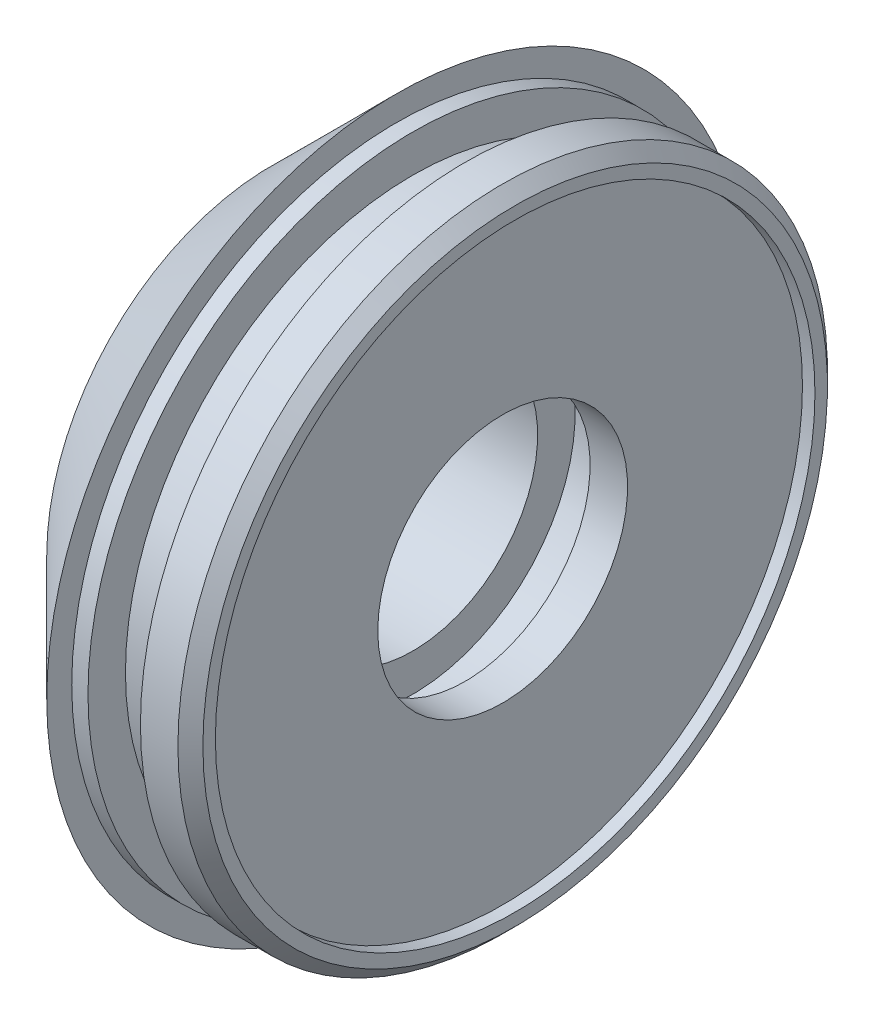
ISO-10303-21;
HEADER;
FILE_DESCRIPTION(('STEP AP214'),'2;1');
FILE_NAME('part.step','',(''),(''),'','','');
FILE_SCHEMA(('AUTOMOTIVE_DESIGN { 1 0 10303 214 1 1 1 1 }'));
ENDSEC;
DATA;
#1=APPLICATION_CONTEXT('core data for automotive mechanical design processes');
#2=APPLICATION_PROTOCOL_DEFINITION('international standard','automotive_design',2000,#1);
#3=PRODUCT_CONTEXT('',#1,'mechanical');
#4=PRODUCT('Part','Part','',(#3));
#5=PRODUCT_RELATED_PRODUCT_CATEGORY('part','',(#4));
#6=PRODUCT_DEFINITION_FORMATION('','',#4);
#7=PRODUCT_DEFINITION_CONTEXT('part definition',#1,'design');
#8=PRODUCT_DEFINITION('design','',#6,#7);
#9=PRODUCT_DEFINITION_SHAPE('','',#8);
#10=(LENGTH_UNIT() NAMED_UNIT(*) SI_UNIT(.MILLI.,.METRE.));
#11=(NAMED_UNIT(*) PLANE_ANGLE_UNIT() SI_UNIT($,.RADIAN.));
#12=(NAMED_UNIT(*) SI_UNIT($,.STERADIAN.) SOLID_ANGLE_UNIT());
#13=UNCERTAINTY_MEASURE_WITH_UNIT(LENGTH_MEASURE(1.E-05),#10,'distance_accuracy_value','');
#14=(GEOMETRIC_REPRESENTATION_CONTEXT(3) GLOBAL_UNCERTAINTY_ASSIGNED_CONTEXT((#13)) GLOBAL_UNIT_ASSIGNED_CONTEXT((#10,
#11,#12)) REPRESENTATION_CONTEXT('',''));
#15=CARTESIAN_POINT('',(0.,0.,0.));
#16=DIRECTION('',(0.,0.,1.));
#17=DIRECTION('',(1.,0.,0.));
#18=AXIS2_PLACEMENT_3D('',#15,#16,#17);
#19=CARTESIAN_POINT('',(-30.,0.,0.));
#20=DIRECTION('',(-1.,0.,0.));
#21=DIRECTION('',(0.,0.,1.));
#22=AXIS2_PLACEMENT_3D('',#19,#20,#21);
#23=CYLINDRICAL_SURFACE('',#22,11.5);
#24=CARTESIAN_POINT('',(5.65,0.,0.));
#25=DIRECTION('',(-1.,0.,0.));
#26=DIRECTION('',(0.,0.,1.));
#27=AXIS2_PLACEMENT_3D('',#24,#25,#26);
#28=CIRCLE('',#27,11.5);
#29=CARTESIAN_POINT('',(5.65,0.,11.5));
#30=VERTEX_POINT('',#29);
#31=EDGE_CURVE('E10',#30,#30,#28,.T.);
#32=ORIENTED_EDGE('',*,*,#31,.F.);
#33=EDGE_LOOP('',(#32));
#34=FACE_BOUND('',#33,.T.);
#35=CARTESIAN_POINT('',(7.75,0.,0.));
#36=DIRECTION('',(-1.,0.,0.));
#37=DIRECTION('',(0.,0.,1.));
#38=AXIS2_PLACEMENT_3D('',#35,#36,#37);
#39=CIRCLE('',#38,11.5);
#40=CARTESIAN_POINT('',(7.75,0.,11.5));
#41=VERTEX_POINT('',#40);
#42=EDGE_CURVE('E106',#41,#41,#39,.T.);
#43=ORIENTED_EDGE('',*,*,#42,.T.);
#44=EDGE_LOOP('',(#43));
#45=FACE_BOUND('',#44,.T.);
#46=ADVANCED_FACE('F35',(#34,#45),#23,.T.);
#47=CARTESIAN_POINT('',(5.65,13.,0.));
#48=DIRECTION('',(-1.,0.,0.));
#49=DIRECTION('',(0.,0.,1.));
#50=AXIS2_PLACEMENT_3D('',#47,#48,#49);
#51=PLANE('',#50);
#52=CARTESIAN_POINT('',(5.65,0.,0.));
#53=DIRECTION('',(-1.,0.,0.));
#54=DIRECTION('',(0.,0.,1.));
#55=AXIS2_PLACEMENT_3D('',#52,#53,#54);
#56=CIRCLE('',#55,13.);
#57=CARTESIAN_POINT('',(5.65,0.,13.));
#58=VERTEX_POINT('',#57);
#59=EDGE_CURVE('E42',#58,#58,#56,.T.);
#60=ORIENTED_EDGE('',*,*,#59,.F.);
#61=EDGE_LOOP('',(#60));
#62=FACE_BOUND('',#61,.T.);
#63=ORIENTED_EDGE('',*,*,#31,.T.);
#64=EDGE_LOOP('',(#63));
#65=FACE_BOUND('',#64,.T.);
#66=ADVANCED_FACE('F198',(#62,#65),#51,.F.);
#67=CARTESIAN_POINT('',(-30.,0.,0.));
#68=DIRECTION('',(-1.,0.,0.));
#69=DIRECTION('',(0.,0.,1.));
#70=AXIS2_PLACEMENT_3D('',#67,#68,#69);
#71=CYLINDRICAL_SURFACE('',#70,13.);
#72=CARTESIAN_POINT('',(5.,0.,0.));
#73=DIRECTION('',(-1.,0.,0.));
#74=DIRECTION('',(0.,0.,1.));
#75=AXIS2_PLACEMENT_3D('',#72,#73,#74);
#76=CIRCLE('',#75,13.);
#77=CARTESIAN_POINT('',(5.,0.,13.));
#78=VERTEX_POINT('',#77);
#79=EDGE_CURVE('E49',#78,#78,#76,.T.);
#80=ORIENTED_EDGE('',*,*,#79,.F.);
#81=EDGE_LOOP('',(#80));
#82=FACE_BOUND('',#81,.T.);
#83=ORIENTED_EDGE('',*,*,#59,.T.);
#84=EDGE_LOOP('',(#83));
#85=FACE_BOUND('',#84,.T.);
#86=ADVANCED_FACE('F193',(#82,#85),#71,.T.);
#87=CARTESIAN_POINT('',(4.99999999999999,14.0000000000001,-1.11022302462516E-13));
#88=DIRECTION('',(-1.,0.,0.));
#89=DIRECTION('',(0.,0.,1.));
#90=AXIS2_PLACEMENT_3D('',#87,#88,#89);
#91=PLANE('',#90);
#92=CARTESIAN_POINT('',(5.,0.,0.));
#93=DIRECTION('',(-1.,0.,0.));
#94=DIRECTION('',(0.,0.,1.));
#95=AXIS2_PLACEMENT_3D('',#92,#93,#94);
#96=CIRCLE('',#95,14.);
#97=CARTESIAN_POINT('',(5.,0.,14.));
#98=VERTEX_POINT('',#97);
#99=EDGE_CURVE('E55',#98,#98,#96,.T.);
#100=ORIENTED_EDGE('',*,*,#99,.F.);
#101=EDGE_LOOP('',(#100));
#102=FACE_BOUND('',#101,.T.);
#103=ORIENTED_EDGE('',*,*,#79,.T.);
#104=EDGE_LOOP('',(#103));
#105=FACE_BOUND('',#104,.T.);
#106=ADVANCED_FACE('F187',(#102,#105),#91,.F.);
#107=CARTESIAN_POINT('',(5.,0.,0.));
#108=DIRECTION('',(1.,0.,0.));
#109=DIRECTION('',(0.,0.,-1.));
#110=AXIS2_PLACEMENT_3D('',#107,#108,#109);
#111=CONICAL_SURFACE('',#110,14.,0.785398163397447);
#112=CARTESIAN_POINT('',(0.,0.,0.));
#113=DIRECTION('',(-1.,0.,0.));
#114=DIRECTION('',(0.,0.,1.));
#115=AXIS2_PLACEMENT_3D('',#112,#113,#114);
#116=CIRCLE('',#115,9.00000000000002);
#117=CARTESIAN_POINT('',(0.,0.,8.99999999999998));
#118=VERTEX_POINT('',#117);
#119=EDGE_CURVE('E61',#118,#118,#116,.T.);
#120=ORIENTED_EDGE('',*,*,#119,.F.);
#121=EDGE_LOOP('',(#120));
#122=FACE_BOUND('',#121,.T.);
#123=ORIENTED_EDGE('',*,*,#99,.T.);
#124=EDGE_LOOP('',(#123));
#125=FACE_BOUND('',#124,.T.);
#126=ADVANCED_FACE('F181',(#122,#125),#111,.T.);
#127=CARTESIAN_POINT('',(0.,4.99999999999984,-1.66533453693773E-13));
#128=DIRECTION('',(1.,0.,0.));
#129=DIRECTION('',(0.,0.,-1.));
#130=AXIS2_PLACEMENT_3D('',#127,#128,#129);
#131=PLANE('',#130);
#132=CARTESIAN_POINT('',(0.,0.,0.));
#133=DIRECTION('',(-1.,0.,0.));
#134=DIRECTION('',(0.,0.,1.));
#135=AXIS2_PLACEMENT_3D('',#132,#133,#134);
#136=CIRCLE('',#135,5.);
#137=CARTESIAN_POINT('',(0.,0.,4.99999999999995));
#138=VERTEX_POINT('',#137);
#139=EDGE_CURVE('E65',#138,#138,#136,.T.);
#140=ORIENTED_EDGE('',*,*,#139,.F.);
#141=EDGE_LOOP('',(#140));
#142=FACE_BOUND('',#141,.T.);
#143=ORIENTED_EDGE('',*,*,#119,.T.);
#144=EDGE_LOOP('',(#143));
#145=FACE_BOUND('',#144,.T.);
#146=ADVANCED_FACE('F175',(#142,#145),#131,.F.);
#147=CARTESIAN_POINT('',(-30.,0.,0.));
#148=DIRECTION('',(-1.,0.,0.));
#149=DIRECTION('',(0.,0.,1.));
#150=AXIS2_PLACEMENT_3D('',#147,#148,#149);
#151=CYLINDRICAL_SURFACE('',#150,5.);
#152=CARTESIAN_POINT('',(5.65,0.,0.));
#153=DIRECTION('',(-1.,0.,0.));
#154=DIRECTION('',(0.,0.,1.));
#155=AXIS2_PLACEMENT_3D('',#152,#153,#154);
#156=CIRCLE('',#155,5.);
#157=CARTESIAN_POINT('',(5.65,0.,4.99999999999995));
#158=VERTEX_POINT('',#157);
#159=EDGE_CURVE('E69',#158,#158,#156,.T.);
#160=ORIENTED_EDGE('',*,*,#159,.F.);
#161=EDGE_LOOP('',(#160));
#162=FACE_BOUND('',#161,.T.);
#163=ORIENTED_EDGE('',*,*,#139,.T.);
#164=EDGE_LOOP('',(#163));
#165=FACE_BOUND('',#164,.T.);
#166=ADVANCED_FACE('F169',(#162,#165),#151,.F.);
#167=CARTESIAN_POINT('',(5.65,4.99999999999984,-1.66533453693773E-13));
#168=DIRECTION('',(-1.,0.,0.));
#169=DIRECTION('',(0.,0.,1.));
#170=AXIS2_PLACEMENT_3D('',#167,#168,#169);
#171=PLANE('',#170);
#172=CARTESIAN_POINT('',(5.65,0.,0.));
#173=DIRECTION('',(-1.,0.,0.));
#174=DIRECTION('',(0.,0.,1.));
#175=AXIS2_PLACEMENT_3D('',#172,#173,#174);
#176=CIRCLE('',#175,6.5);
#177=CARTESIAN_POINT('',(5.65,0.,6.49999999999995));
#178=VERTEX_POINT('',#177);
#179=EDGE_CURVE('E73',#178,#178,#176,.T.);
#180=ORIENTED_EDGE('',*,*,#179,.F.);
#181=EDGE_LOOP('',(#180));
#182=FACE_BOUND('',#181,.T.);
#183=ORIENTED_EDGE('',*,*,#159,.T.);
#184=EDGE_LOOP('',(#183));
#185=FACE_BOUND('',#184,.T.);
#186=ADVANCED_FACE('F163',(#182,#185),#171,.F.);
#187=CARTESIAN_POINT('',(-30.,0.,0.));
#188=DIRECTION('',(-1.,0.,0.));
#189=DIRECTION('',(0.,0.,1.));
#190=AXIS2_PLACEMENT_3D('',#187,#188,#189);
#191=CYLINDRICAL_SURFACE('',#190,6.5);
#192=CARTESIAN_POINT('',(7.75000000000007,0.,0.));
#193=DIRECTION('',(-1.,0.,0.));
#194=DIRECTION('',(0.,0.,1.));
#195=AXIS2_PLACEMENT_3D('',#192,#193,#194);
#196=CIRCLE('',#195,6.5);
#197=CARTESIAN_POINT('',(7.75000000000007,0.,6.49999999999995));
#198=VERTEX_POINT('',#197);
#199=EDGE_CURVE('E76',#198,#198,#196,.T.);
#200=ORIENTED_EDGE('',*,*,#199,.F.);
#201=EDGE_LOOP('',(#200));
#202=FACE_BOUND('',#201,.T.);
#203=ORIENTED_EDGE('',*,*,#179,.T.);
#204=EDGE_LOOP('',(#203));
#205=FACE_BOUND('',#204,.T.);
#206=ADVANCED_FACE('F157',(#202,#205),#191,.F.);
#207=CARTESIAN_POINT('',(7.75000000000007,6.50000000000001,0.));
#208=DIRECTION('',(1.,0.,0.));
#209=DIRECTION('',(0.,0.,-1.));
#210=AXIS2_PLACEMENT_3D('',#207,#208,#209);
#211=PLANE('',#210);
#212=CARTESIAN_POINT('',(7.75000000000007,0.,0.));
#213=DIRECTION('',(-1.,0.,0.));
#214=DIRECTION('',(0.,0.,1.));
#215=AXIS2_PLACEMENT_3D('',#212,#213,#214);
#216=CIRCLE('',#215,5.);
#217=CARTESIAN_POINT('',(7.75000000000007,0.,4.99999999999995));
#218=VERTEX_POINT('',#217);
#219=EDGE_CURVE('E80',#218,#218,#216,.T.);
#220=ORIENTED_EDGE('',*,*,#219,.F.);
#221=EDGE_LOOP('',(#220));
#222=FACE_BOUND('',#221,.T.);
#223=ORIENTED_EDGE('',*,*,#199,.T.);
#224=EDGE_LOOP('',(#223));
#225=FACE_BOUND('',#224,.T.);
#226=ADVANCED_FACE('F151',(#222,#225),#211,.F.);
#227=CARTESIAN_POINT('',(-30.,0.,0.));
#228=DIRECTION('',(-1.,0.,0.));
#229=DIRECTION('',(0.,0.,1.));
#230=AXIS2_PLACEMENT_3D('',#227,#228,#229);
#231=CYLINDRICAL_SURFACE('',#230,5.00000000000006);
#232=CARTESIAN_POINT('',(9.24999999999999,0.,0.));
#233=DIRECTION('',(-1.,0.,0.));
#234=DIRECTION('',(0.,0.,1.));
#235=AXIS2_PLACEMENT_3D('',#232,#233,#234);
#236=CIRCLE('',#235,5.00000000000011);
#237=CARTESIAN_POINT('',(9.24999999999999,0.,5.00000000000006));
#238=VERTEX_POINT('',#237);
#239=EDGE_CURVE('E84',#238,#238,#236,.T.);
#240=ORIENTED_EDGE('',*,*,#239,.F.);
#241=EDGE_LOOP('',(#240));
#242=FACE_BOUND('',#241,.T.);
#243=ORIENTED_EDGE('',*,*,#219,.T.);
#244=EDGE_LOOP('',(#243));
#245=FACE_BOUND('',#244,.T.);
#246=ADVANCED_FACE('F145',(#242,#245),#231,.F.);
#247=CARTESIAN_POINT('',(9.24999999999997,11.9999999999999,-1.11022302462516E-13));
#248=DIRECTION('',(-1.,0.,0.));
#249=DIRECTION('',(0.,0.,1.));
#250=AXIS2_PLACEMENT_3D('',#247,#248,#249);
#251=PLANE('',#250);
#252=CARTESIAN_POINT('',(9.24999999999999,0.,0.));
#253=DIRECTION('',(-1.,0.,0.));
#254=DIRECTION('',(0.,0.,1.));
#255=AXIS2_PLACEMENT_3D('',#252,#253,#254);
#256=CIRCLE('',#255,12.);
#257=CARTESIAN_POINT('',(9.24999999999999,0.,12.));
#258=VERTEX_POINT('',#257);
#259=EDGE_CURVE('E87',#258,#258,#256,.T.);
#260=ORIENTED_EDGE('',*,*,#259,.F.);
#261=EDGE_LOOP('',(#260));
#262=FACE_BOUND('',#261,.T.);
#263=ORIENTED_EDGE('',*,*,#239,.T.);
#264=EDGE_LOOP('',(#263));
#265=FACE_BOUND('',#264,.T.);
#266=ADVANCED_FACE('F139',(#262,#265),#251,.F.);
#267=CARTESIAN_POINT('',(-30.,0.,0.));
#268=DIRECTION('',(-1.,0.,0.));
#269=DIRECTION('',(0.,0.,1.));
#270=AXIS2_PLACEMENT_3D('',#267,#268,#269);
#271=CYLINDRICAL_SURFACE('',#270,12.);
#272=CARTESIAN_POINT('',(9.75,0.,0.));
#273=DIRECTION('',(-1.,0.,0.));
#274=DIRECTION('',(0.,0.,1.));
#275=AXIS2_PLACEMENT_3D('',#272,#273,#274);
#276=CIRCLE('',#275,12.);
#277=CARTESIAN_POINT('',(9.75,0.,12.));
#278=VERTEX_POINT('',#277);
#279=EDGE_CURVE('E91',#278,#278,#276,.T.);
#280=ORIENTED_EDGE('',*,*,#279,.F.);
#281=EDGE_LOOP('',(#280));
#282=FACE_BOUND('',#281,.T.);
#283=ORIENTED_EDGE('',*,*,#259,.T.);
#284=EDGE_LOOP('',(#283));
#285=FACE_BOUND('',#284,.T.);
#286=ADVANCED_FACE('F133',(#282,#285),#271,.F.);
#287=CARTESIAN_POINT('',(9.74999999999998,12.5,0.));
#288=DIRECTION('',(-1.,0.,0.));
#289=DIRECTION('',(0.,0.,1.));
#290=AXIS2_PLACEMENT_3D('',#287,#288,#289);
#291=PLANE('',#290);
#292=CARTESIAN_POINT('',(9.75,0.,0.));
#293=DIRECTION('',(-1.,0.,0.));
#294=DIRECTION('',(0.,0.,1.));
#295=AXIS2_PLACEMENT_3D('',#292,#293,#294);
#296=CIRCLE('',#295,12.5);
#297=CARTESIAN_POINT('',(9.75,0.,12.5));
#298=VERTEX_POINT('',#297);
#299=EDGE_CURVE('E94',#298,#298,#296,.T.);
#300=ORIENTED_EDGE('',*,*,#299,.F.);
#301=EDGE_LOOP('',(#300));
#302=FACE_BOUND('',#301,.T.);
#303=ORIENTED_EDGE('',*,*,#279,.T.);
#304=EDGE_LOOP('',(#303));
#305=FACE_BOUND('',#304,.T.);
#306=ADVANCED_FACE('F127',(#302,#305),#291,.F.);
#307=CARTESIAN_POINT('',(9.75,0.,0.));
#308=DIRECTION('',(-1.,0.,0.));
#309=DIRECTION('',(0.,0.,1.));
#310=AXIS2_PLACEMENT_3D('',#307,#308,#309);
#311=CONICAL_SURFACE('',#310,12.5,0.785398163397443);
#312=CARTESIAN_POINT('',(9.25,0.,0.));
#313=DIRECTION('',(-1.,0.,0.));
#314=DIRECTION('',(0.,0.,1.));
#315=AXIS2_PLACEMENT_3D('',#312,#313,#314);
#316=CIRCLE('',#315,13.);
#317=CARTESIAN_POINT('',(9.25,0.,13.));
#318=VERTEX_POINT('',#317);
#319=EDGE_CURVE('E98',#318,#318,#316,.T.);
#320=ORIENTED_EDGE('',*,*,#319,.F.);
#321=EDGE_LOOP('',(#320));
#322=FACE_BOUND('',#321,.T.);
#323=ORIENTED_EDGE('',*,*,#299,.T.);
#324=EDGE_LOOP('',(#323));
#325=FACE_BOUND('',#324,.T.);
#326=ADVANCED_FACE('F121',(#322,#325),#311,.T.);
#327=CARTESIAN_POINT('',(-30.,0.,0.));
#328=DIRECTION('',(-1.,0.,0.));
#329=DIRECTION('',(0.,0.,1.));
#330=AXIS2_PLACEMENT_3D('',#327,#328,#329);
#331=CYLINDRICAL_SURFACE('',#330,13.);
#332=CARTESIAN_POINT('',(7.75,0.,0.));
#333=DIRECTION('',(-1.,0.,0.));
#334=DIRECTION('',(0.,0.,1.));
#335=AXIS2_PLACEMENT_3D('',#332,#333,#334);
#336=CIRCLE('',#335,13.);
#337=CARTESIAN_POINT('',(7.75,0.,13.));
#338=VERTEX_POINT('',#337);
#339=EDGE_CURVE('E102',#338,#338,#336,.T.);
#340=ORIENTED_EDGE('',*,*,#339,.F.);
#341=EDGE_LOOP('',(#340));
#342=FACE_BOUND('',#341,.T.);
#343=ORIENTED_EDGE('',*,*,#319,.T.);
#344=EDGE_LOOP('',(#343));
#345=FACE_BOUND('',#344,.T.);
#346=ADVANCED_FACE('F115',(#342,#345),#331,.T.);
#347=CARTESIAN_POINT('',(7.74999999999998,11.5,-1.66533453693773E-13));
#348=DIRECTION('',(1.,0.,0.));
#349=DIRECTION('',(0.,0.,-1.));
#350=AXIS2_PLACEMENT_3D('',#347,#348,#349);
#351=PLANE('',#350);
#352=ORIENTED_EDGE('',*,*,#42,.F.);
#353=EDGE_LOOP('',(#352));
#354=FACE_BOUND('',#353,.T.);
#355=ORIENTED_EDGE('',*,*,#339,.T.);
#356=EDGE_LOOP('',(#355));
#357=FACE_BOUND('',#356,.T.);
#358=ADVANCED_FACE('F112',(#354,#357),#351,.F.);
#359=CLOSED_SHELL('',(#46,#66,#86,#106,#126,#146,#166,#186,#206,#226,#246,#266,#286,#306,#326,
#346,#358));
#360=MANIFOLD_SOLID_BREP('B2',#359);
#361=ADVANCED_BREP_SHAPE_REPRESENTATION('',(#18,#360),#14);
#362=SHAPE_DEFINITION_REPRESENTATION(#9,#361);
ENDSEC;
END-ISO-10303-21;
